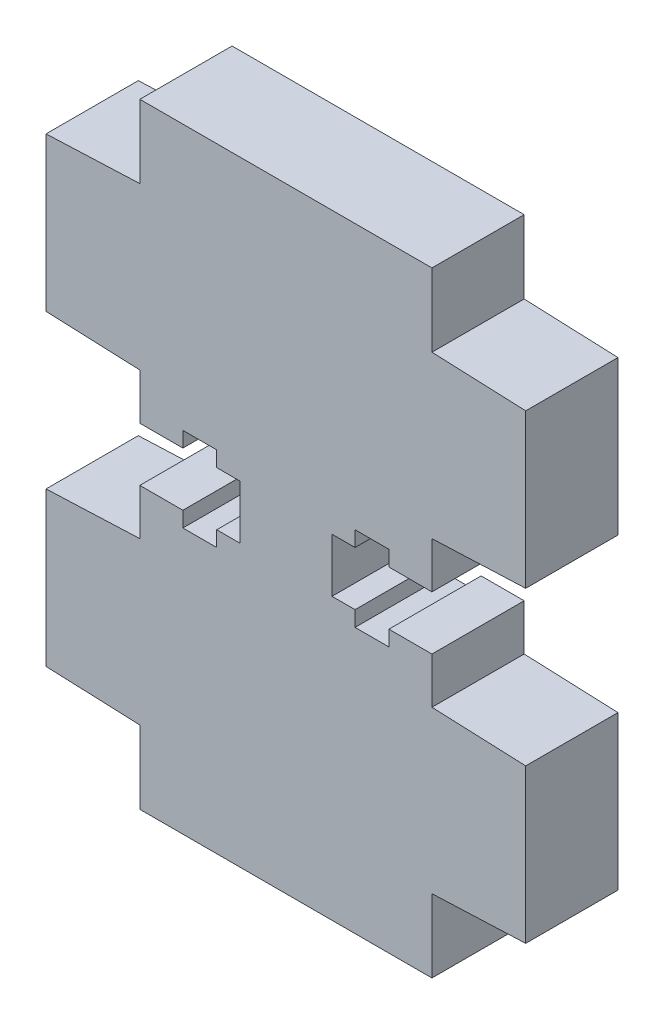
ISO-10303-21;
HEADER;
FILE_DESCRIPTION(('STEP AP214'),'2;1');
FILE_NAME('part.step','',(''),(''),'','','');
FILE_SCHEMA(('AUTOMOTIVE_DESIGN { 1 0 10303 214 1 1 1 1 }'));
ENDSEC;
DATA;
#1=APPLICATION_CONTEXT('core data for automotive mechanical design processes');
#2=APPLICATION_PROTOCOL_DEFINITION('international standard','automotive_design',2000,#1);
#3=PRODUCT_CONTEXT('',#1,'mechanical');
#4=PRODUCT('Part','Part','',(#3));
#5=PRODUCT_RELATED_PRODUCT_CATEGORY('part','',(#4));
#6=PRODUCT_DEFINITION_FORMATION('','',#4);
#7=PRODUCT_DEFINITION_CONTEXT('part definition',#1,'design');
#8=PRODUCT_DEFINITION('design','',#6,#7);
#9=PRODUCT_DEFINITION_SHAPE('','',#8);
#10=(LENGTH_UNIT() NAMED_UNIT(*) SI_UNIT(.MILLI.,.METRE.));
#11=(NAMED_UNIT(*) PLANE_ANGLE_UNIT() SI_UNIT($,.RADIAN.));
#12=(NAMED_UNIT(*) SI_UNIT($,.STERADIAN.) SOLID_ANGLE_UNIT());
#13=UNCERTAINTY_MEASURE_WITH_UNIT(LENGTH_MEASURE(1.E-05),#10,'distance_accuracy_value','');
#14=(GEOMETRIC_REPRESENTATION_CONTEXT(3) GLOBAL_UNCERTAINTY_ASSIGNED_CONTEXT((#13)) GLOBAL_UNIT_ASSIGNED_CONTEXT((#10,
#11,#12)) REPRESENTATION_CONTEXT('',''));
#15=CARTESIAN_POINT('',(0.,0.,0.));
#16=DIRECTION('',(0.,0.,1.));
#17=DIRECTION('',(1.,0.,0.));
#18=AXIS2_PLACEMENT_3D('',#15,#16,#17);
#19=CARTESIAN_POINT('',(3.,1.75,6.));
#20=DIRECTION('',(-1.,0.,0.));
#21=DIRECTION('',(0.,0.,1.));
#22=AXIS2_PLACEMENT_3D('',#19,#20,#21);
#23=PLANE('',#22);
#24=DIRECTION('',(0.,1.,0.));
#25=VECTOR('',#24,1.);
#26=CARTESIAN_POINT('',(3.,1.75,0.));
#27=LINE('',#26,#25);
#28=CARTESIAN_POINT('',(3.,-1.75,0.));
#29=VERTEX_POINT('',#28);
#30=CARTESIAN_POINT('',(3.,1.75,0.));
#31=VERTEX_POINT('',#30);
#32=EDGE_CURVE('E156',#29,#31,#27,.T.);
#33=ORIENTED_EDGE('',*,*,#32,.T.);
#34=DIRECTION('',(0.,0.,-1.));
#35=VECTOR('',#34,1.);
#36=CARTESIAN_POINT('',(3.,1.75,6.));
#37=LINE('',#36,#35);
#38=CARTESIAN_POINT('',(3.,1.75,6.));
#39=VERTEX_POINT('',#38);
#40=EDGE_CURVE('E11',#39,#31,#37,.T.);
#41=ORIENTED_EDGE('',*,*,#40,.F.);
#42=DIRECTION('',(0.,1.,0.));
#43=VECTOR('',#42,1.);
#44=CARTESIAN_POINT('',(3.,1.75,6.));
#45=LINE('',#44,#43);
#46=CARTESIAN_POINT('',(3.,-1.75,6.));
#47=VERTEX_POINT('',#46);
#48=EDGE_CURVE('E103',#47,#39,#45,.T.);
#49=ORIENTED_EDGE('',*,*,#48,.F.);
#50=DIRECTION('',(0.,0.,-1.));
#51=VECTOR('',#50,1.);
#52=CARTESIAN_POINT('',(3.,-1.75,6.));
#53=LINE('',#52,#51);
#54=EDGE_CURVE('E302',#47,#29,#53,.T.);
#55=ORIENTED_EDGE('',*,*,#54,.T.);
#56=EDGE_LOOP('',(#33,#41,#49,#55));
#57=FACE_BOUND('',#56,.T.);
#58=ADVANCED_FACE('F34',(#57),#23,.F.);
#59=CARTESIAN_POINT('',(4.5,1.75,6.));
#60=DIRECTION('',(0.,1.,0.));
#61=DIRECTION('',(-1.,0.,0.));
#62=AXIS2_PLACEMENT_3D('',#59,#60,#61);
#63=PLANE('',#62);
#64=DIRECTION('',(1.,0.,0.));
#65=VECTOR('',#64,1.);
#66=CARTESIAN_POINT('',(4.5,1.75,0.));
#67=LINE('',#66,#65);
#68=CARTESIAN_POINT('',(4.5,1.75,0.));
#69=VERTEX_POINT('',#68);
#70=EDGE_CURVE('E158',#31,#69,#67,.T.);
#71=ORIENTED_EDGE('',*,*,#70,.T.);
#72=DIRECTION('',(0.,0.,-1.));
#73=VECTOR('',#72,1.);
#74=CARTESIAN_POINT('',(4.5,1.75,6.));
#75=LINE('',#74,#73);
#76=CARTESIAN_POINT('',(4.5,1.75,6.));
#77=VERTEX_POINT('',#76);
#78=EDGE_CURVE('E42',#77,#69,#75,.T.);
#79=ORIENTED_EDGE('',*,*,#78,.F.);
#80=DIRECTION('',(1.,0.,0.));
#81=VECTOR('',#80,1.);
#82=CARTESIAN_POINT('',(4.5,1.75,6.));
#83=LINE('',#82,#81);
#84=EDGE_CURVE('E295',#39,#77,#83,.T.);
#85=ORIENTED_EDGE('',*,*,#84,.F.);
#86=ORIENTED_EDGE('',*,*,#40,.T.);
#87=EDGE_LOOP('',(#71,#79,#85,#86));
#88=FACE_BOUND('',#87,.T.);
#89=ADVANCED_FACE('F296',(#88),#63,.F.);
#90=CARTESIAN_POINT('',(4.5,2.75,6.));
#91=DIRECTION('',(-1.,0.,0.));
#92=DIRECTION('',(0.,-1.,0.));
#93=AXIS2_PLACEMENT_3D('',#90,#91,#92);
#94=PLANE('',#93);
#95=DIRECTION('',(0.,1.,0.));
#96=VECTOR('',#95,1.);
#97=CARTESIAN_POINT('',(4.5,2.75,0.));
#98=LINE('',#97,#96);
#99=CARTESIAN_POINT('',(4.5,2.75,0.));
#100=VERTEX_POINT('',#99);
#101=EDGE_CURVE('E161',#69,#100,#98,.T.);
#102=ORIENTED_EDGE('',*,*,#101,.T.);
#103=DIRECTION('',(0.,0.,-1.));
#104=VECTOR('',#103,1.);
#105=CARTESIAN_POINT('',(4.5,2.75,6.));
#106=LINE('',#105,#104);
#107=CARTESIAN_POINT('',(4.5,2.75,6.));
#108=VERTEX_POINT('',#107);
#109=EDGE_CURVE('E194',#108,#100,#106,.T.);
#110=ORIENTED_EDGE('',*,*,#109,.F.);
#111=DIRECTION('',(0.,1.,0.));
#112=VECTOR('',#111,1.);
#113=CARTESIAN_POINT('',(4.5,2.75,6.));
#114=LINE('',#113,#112);
#115=EDGE_CURVE('E203',#77,#108,#114,.T.);
#116=ORIENTED_EDGE('',*,*,#115,.F.);
#117=ORIENTED_EDGE('',*,*,#78,.T.);
#118=EDGE_LOOP('',(#102,#110,#116,#117));
#119=FACE_BOUND('',#118,.T.);
#120=ADVANCED_FACE('F201',(#119),#94,.F.);
#121=CARTESIAN_POINT('',(6.7,2.75,6.));
#122=DIRECTION('',(0.,1.,0.));
#123=DIRECTION('',(-1.,0.,0.));
#124=AXIS2_PLACEMENT_3D('',#121,#122,#123);
#125=PLANE('',#124);
#126=DIRECTION('',(1.,0.,0.));
#127=VECTOR('',#126,1.);
#128=CARTESIAN_POINT('',(6.7,2.75,0.));
#129=LINE('',#128,#127);
#130=CARTESIAN_POINT('',(6.7,2.75,0.));
#131=VERTEX_POINT('',#130);
#132=EDGE_CURVE('E163',#100,#131,#129,.T.);
#133=ORIENTED_EDGE('',*,*,#132,.T.);
#134=DIRECTION('',(0.,0.,-1.));
#135=VECTOR('',#134,1.);
#136=CARTESIAN_POINT('',(6.7,2.75,6.));
#137=LINE('',#136,#135);
#138=CARTESIAN_POINT('',(6.7,2.75,6.));
#139=VERTEX_POINT('',#138);
#140=EDGE_CURVE('E191',#139,#131,#137,.T.);
#141=ORIENTED_EDGE('',*,*,#140,.F.);
#142=DIRECTION('',(1.,0.,0.));
#143=VECTOR('',#142,1.);
#144=CARTESIAN_POINT('',(6.7,2.75,6.));
#145=LINE('',#144,#143);
#146=EDGE_CURVE('E224',#108,#139,#145,.T.);
#147=ORIENTED_EDGE('',*,*,#146,.F.);
#148=ORIENTED_EDGE('',*,*,#109,.T.);
#149=EDGE_LOOP('',(#133,#141,#147,#148));
#150=FACE_BOUND('',#149,.T.);
#151=ADVANCED_FACE('F215',(#150),#125,.F.);
#152=CARTESIAN_POINT('',(6.7,1.75,6.));
#153=DIRECTION('',(1.,0.,0.));
#154=DIRECTION('',(0.,1.,0.));
#155=AXIS2_PLACEMENT_3D('',#152,#153,#154);
#156=PLANE('',#155);
#157=DIRECTION('',(0.,-1.,0.));
#158=VECTOR('',#157,1.);
#159=CARTESIAN_POINT('',(6.7,1.75,0.));
#160=LINE('',#159,#158);
#161=CARTESIAN_POINT('',(6.7,1.75,0.));
#162=VERTEX_POINT('',#161);
#163=EDGE_CURVE('E165',#131,#162,#160,.T.);
#164=ORIENTED_EDGE('',*,*,#163,.T.);
#165=DIRECTION('',(0.,0.,-1.));
#166=VECTOR('',#165,1.);
#167=CARTESIAN_POINT('',(6.7,1.75,6.));
#168=LINE('',#167,#166);
#169=CARTESIAN_POINT('',(6.7,1.75,6.));
#170=VERTEX_POINT('',#169);
#171=EDGE_CURVE('E188',#170,#162,#168,.T.);
#172=ORIENTED_EDGE('',*,*,#171,.F.);
#173=DIRECTION('',(0.,-1.,0.));
#174=VECTOR('',#173,1.);
#175=CARTESIAN_POINT('',(6.7,1.75,6.));
#176=LINE('',#175,#174);
#177=EDGE_CURVE('E221',#139,#170,#176,.T.);
#178=ORIENTED_EDGE('',*,*,#177,.F.);
#179=ORIENTED_EDGE('',*,*,#140,.T.);
#180=EDGE_LOOP('',(#164,#172,#178,#179));
#181=FACE_BOUND('',#180,.T.);
#182=ADVANCED_FACE('F219',(#181),#156,.F.);
#183=CARTESIAN_POINT('',(9.5,1.75,6.));
#184=DIRECTION('',(0.,1.,0.));
#185=DIRECTION('',(-1.,0.,0.));
#186=AXIS2_PLACEMENT_3D('',#183,#184,#185);
#187=PLANE('',#186);
#188=DIRECTION('',(1.,0.,0.));
#189=VECTOR('',#188,1.);
#190=CARTESIAN_POINT('',(9.5,1.75,0.));
#191=LINE('',#190,#189);
#192=CARTESIAN_POINT('',(9.5,1.75,0.));
#193=VERTEX_POINT('',#192);
#194=EDGE_CURVE('E167',#162,#193,#191,.T.);
#195=ORIENTED_EDGE('',*,*,#194,.T.);
#196=DIRECTION('',(0.,0.,-1.));
#197=VECTOR('',#196,1.);
#198=CARTESIAN_POINT('',(9.5,1.75,6.));
#199=LINE('',#198,#197);
#200=CARTESIAN_POINT('',(9.5,1.75,6.));
#201=VERTEX_POINT('',#200);
#202=EDGE_CURVE('E185',#201,#193,#199,.T.);
#203=ORIENTED_EDGE('',*,*,#202,.F.);
#204=DIRECTION('',(1.,0.,0.));
#205=VECTOR('',#204,1.);
#206=CARTESIAN_POINT('',(9.5,1.75,6.));
#207=LINE('',#206,#205);
#208=EDGE_CURVE('E223',#170,#201,#207,.T.);
#209=ORIENTED_EDGE('',*,*,#208,.F.);
#210=ORIENTED_EDGE('',*,*,#171,.T.);
#211=EDGE_LOOP('',(#195,#203,#209,#210));
#212=FACE_BOUND('',#211,.T.);
#213=ADVANCED_FACE('F812',(#212),#187,.F.);
#214=CARTESIAN_POINT('',(9.5,4.75,6.));
#215=DIRECTION('',(-1.,0.,0.));
#216=DIRECTION('',(0.,0.,1.));
#217=AXIS2_PLACEMENT_3D('',#214,#215,#216);
#218=PLANE('',#217);
#219=DIRECTION('',(0.,1.,0.));
#220=VECTOR('',#219,1.);
#221=CARTESIAN_POINT('',(9.5,4.75,0.));
#222=LINE('',#221,#220);
#223=CARTESIAN_POINT('',(9.5,4.75,0.));
#224=VERTEX_POINT('',#223);
#225=EDGE_CURVE('E169',#193,#224,#222,.T.);
#226=ORIENTED_EDGE('',*,*,#225,.T.);
#227=DIRECTION('',(0.,0.,-1.));
#228=VECTOR('',#227,1.);
#229=CARTESIAN_POINT('',(9.5,4.75,6.));
#230=LINE('',#229,#228);
#231=CARTESIAN_POINT('',(9.5,4.75,6.));
#232=VERTEX_POINT('',#231);
#233=EDGE_CURVE('E182',#232,#224,#230,.T.);
#234=ORIENTED_EDGE('',*,*,#233,.F.);
#235=DIRECTION('',(0.,1.,0.));
#236=VECTOR('',#235,1.);
#237=CARTESIAN_POINT('',(9.5,4.75,6.));
#238=LINE('',#237,#236);
#239=EDGE_CURVE('E226',#201,#232,#238,.T.);
#240=ORIENTED_EDGE('',*,*,#239,.F.);
#241=ORIENTED_EDGE('',*,*,#202,.T.);
#242=EDGE_LOOP('',(#226,#234,#240,#241));
#243=FACE_BOUND('',#242,.T.);
#244=ADVANCED_FACE('F235',(#243),#218,.F.);
#245=CARTESIAN_POINT('',(15.6,5.,6.));
#246=DIRECTION('',(-0.0409492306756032,0.999161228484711,0.));
#247=DIRECTION('',(-0.999161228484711,-0.0409492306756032,0.));
#248=AXIS2_PLACEMENT_3D('',#245,#246,#247);
#249=PLANE('',#248);
#250=DIRECTION('',(0.999161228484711,0.0409492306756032,0.));
#251=VECTOR('',#250,1.);
#252=CARTESIAN_POINT('',(15.6,5.,0.));
#253=LINE('',#252,#251);
#254=CARTESIAN_POINT('',(15.6,5.,0.));
#255=VERTEX_POINT('',#254);
#256=EDGE_CURVE('E171',#224,#255,#253,.T.);
#257=ORIENTED_EDGE('',*,*,#256,.T.);
#258=DIRECTION('',(0.,0.,-1.));
#259=VECTOR('',#258,1.);
#260=CARTESIAN_POINT('',(15.6,5.,6.));
#261=LINE('',#260,#259);
#262=CARTESIAN_POINT('',(15.6,5.,6.));
#263=VERTEX_POINT('',#262);
#264=EDGE_CURVE('E145',#263,#255,#261,.T.);
#265=ORIENTED_EDGE('',*,*,#264,.F.);
#266=DIRECTION('',(0.999161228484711,0.0409492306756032,0.));
#267=VECTOR('',#266,1.);
#268=CARTESIAN_POINT('',(15.6,5.,6.));
#269=LINE('',#268,#267);
#270=EDGE_CURVE('E136',#232,#263,#269,.T.);
#271=ORIENTED_EDGE('',*,*,#270,.F.);
#272=ORIENTED_EDGE('',*,*,#233,.T.);
#273=EDGE_LOOP('',(#257,#265,#271,#272));
#274=FACE_BOUND('',#273,.T.);
#275=ADVANCED_FACE('F239',(#274),#249,.F.);
#276=CARTESIAN_POINT('',(15.6,15.,6.));
#277=DIRECTION('',(-1.,0.,0.));
#278=DIRECTION('',(0.,-1.,0.));
#279=AXIS2_PLACEMENT_3D('',#276,#277,#278);
#280=PLANE('',#279);
#281=DIRECTION('',(0.,1.,0.));
#282=VECTOR('',#281,1.);
#283=CARTESIAN_POINT('',(15.6,15.,0.));
#284=LINE('',#283,#282);
#285=CARTESIAN_POINT('',(15.6,15.,0.));
#286=VERTEX_POINT('',#285);
#287=EDGE_CURVE('E144',#255,#286,#284,.T.);
#288=ORIENTED_EDGE('',*,*,#287,.T.);
#289=DIRECTION('',(0.,0.,-1.));
#290=VECTOR('',#289,1.);
#291=CARTESIAN_POINT('',(15.6,15.,6.));
#292=LINE('',#291,#290);
#293=CARTESIAN_POINT('',(15.6,15.,6.));
#294=VERTEX_POINT('',#293);
#295=EDGE_CURVE('E141',#294,#286,#292,.T.);
#296=ORIENTED_EDGE('',*,*,#295,.F.);
#297=DIRECTION('',(0.,1.,0.));
#298=VECTOR('',#297,1.);
#299=CARTESIAN_POINT('',(15.6,15.,6.));
#300=LINE('',#299,#298);
#301=EDGE_CURVE('E129',#263,#294,#300,.T.);
#302=ORIENTED_EDGE('',*,*,#301,.F.);
#303=ORIENTED_EDGE('',*,*,#264,.T.);
#304=EDGE_LOOP('',(#288,#296,#302,#303));
#305=FACE_BOUND('',#304,.T.);
#306=ADVANCED_FACE('F142',(#305),#280,.F.);
#307=CARTESIAN_POINT('',(9.5,15.25,6.));
#308=DIRECTION('',(-0.0409492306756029,-0.999161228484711,0.));
#309=DIRECTION('',(0.999161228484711,-0.0409492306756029,0.));
#310=AXIS2_PLACEMENT_3D('',#307,#308,#309);
#311=PLANE('',#310);
#312=DIRECTION('',(-0.999161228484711,0.0409492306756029,0.));
#313=VECTOR('',#312,1.);
#314=CARTESIAN_POINT('',(9.5,15.25,0.));
#315=LINE('',#314,#313);
#316=CARTESIAN_POINT('',(9.5,15.25,0.));
#317=VERTEX_POINT('',#316);
#318=EDGE_CURVE('E89',#286,#317,#315,.T.);
#319=ORIENTED_EDGE('',*,*,#318,.T.);
#320=DIRECTION('',(0.,0.,-1.));
#321=VECTOR('',#320,1.);
#322=CARTESIAN_POINT('',(9.5,15.25,6.));
#323=LINE('',#322,#321);
#324=CARTESIAN_POINT('',(9.5,15.25,6.));
#325=VERTEX_POINT('',#324);
#326=EDGE_CURVE('E146',#325,#317,#323,.T.);
#327=ORIENTED_EDGE('',*,*,#326,.F.);
#328=DIRECTION('',(-0.999161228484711,0.0409492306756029,0.));
#329=VECTOR('',#328,1.);
#330=CARTESIAN_POINT('',(9.5,15.25,6.));
#331=LINE('',#330,#329);
#332=EDGE_CURVE('E134',#294,#325,#331,.T.);
#333=ORIENTED_EDGE('',*,*,#332,.F.);
#334=ORIENTED_EDGE('',*,*,#295,.T.);
#335=EDGE_LOOP('',(#319,#327,#333,#334));
#336=FACE_BOUND('',#335,.T.);
#337=ADVANCED_FACE('F148',(#336),#311,.F.);
#338=CARTESIAN_POINT('',(9.5,20.,6.));
#339=DIRECTION('',(-1.,0.,0.));
#340=DIRECTION('',(0.,0.,1.));
#341=AXIS2_PLACEMENT_3D('',#338,#339,#340);
#342=PLANE('',#341);
#343=DIRECTION('',(0.,1.,0.));
#344=VECTOR('',#343,1.);
#345=CARTESIAN_POINT('',(9.5,20.,0.));
#346=LINE('',#345,#344);
#347=CARTESIAN_POINT('',(9.5,20.,0.));
#348=VERTEX_POINT('',#347);
#349=EDGE_CURVE('E95',#317,#348,#346,.T.);
#350=ORIENTED_EDGE('',*,*,#349,.T.);
#351=DIRECTION('',(0.,0.,-1.));
#352=VECTOR('',#351,1.);
#353=CARTESIAN_POINT('',(9.5,20.,6.));
#354=LINE('',#353,#352);
#355=CARTESIAN_POINT('',(9.5,20.,6.));
#356=VERTEX_POINT('',#355);
#357=EDGE_CURVE('E155',#356,#348,#354,.T.);
#358=ORIENTED_EDGE('',*,*,#357,.F.);
#359=DIRECTION('',(0.,1.,0.));
#360=VECTOR('',#359,1.);
#361=CARTESIAN_POINT('',(9.5,20.,6.));
#362=LINE('',#361,#360);
#363=EDGE_CURVE('E50',#325,#356,#362,.T.);
#364=ORIENTED_EDGE('',*,*,#363,.F.);
#365=ORIENTED_EDGE('',*,*,#326,.T.);
#366=EDGE_LOOP('',(#350,#358,#364,#365));
#367=FACE_BOUND('',#366,.T.);
#368=ADVANCED_FACE('F824',(#367),#342,.F.);
#369=CARTESIAN_POINT('',(0.,20.,6.));
#370=DIRECTION('',(0.,-1.,0.));
#371=DIRECTION('',(0.,0.,-1.));
#372=AXIS2_PLACEMENT_3D('',#369,#370,#371);
#373=PLANE('',#372);
#374=DIRECTION('',(-1.,0.,0.));
#375=VECTOR('',#374,1.);
#376=CARTESIAN_POINT('',(0.,20.,0.));
#377=LINE('',#376,#375);
#378=CARTESIAN_POINT('',(-9.5,20.,0.));
#379=VERTEX_POINT('',#378);
#380=EDGE_CURVE('E176',#348,#379,#377,.T.);
#381=ORIENTED_EDGE('',*,*,#380,.T.);
#382=DIRECTION('',(0.,0.,-1.));
#383=VECTOR('',#382,1.);
#384=CARTESIAN_POINT('',(-9.5,20.,6.));
#385=LINE('',#384,#383);
#386=CARTESIAN_POINT('',(-9.5,20.,6.));
#387=VERTEX_POINT('',#386);
#388=EDGE_CURVE('E250',#387,#379,#385,.T.);
#389=ORIENTED_EDGE('',*,*,#388,.F.);
#390=DIRECTION('',(-1.,0.,0.));
#391=VECTOR('',#390,1.);
#392=CARTESIAN_POINT('',(0.,20.,6.));
#393=LINE('',#392,#391);
#394=EDGE_CURVE('E150',#356,#387,#393,.T.);
#395=ORIENTED_EDGE('',*,*,#394,.F.);
#396=ORIENTED_EDGE('',*,*,#357,.T.);
#397=EDGE_LOOP('',(#381,#389,#395,#396));
#398=FACE_BOUND('',#397,.T.);
#399=ADVANCED_FACE('F248',(#398),#373,.F.);
#400=CARTESIAN_POINT('',(0.,0.,6.));
#401=DIRECTION('',(0.,0.,-1.));
#402=DIRECTION('',(-1.,0.,0.));
#403=AXIS2_PLACEMENT_3D('',#400,#401,#402);
#404=PLANE('',#403);
#405=DIRECTION('',(0.,1.,0.));
#406=VECTOR('',#405,1.);
#407=CARTESIAN_POINT('',(-3.,1.75,6.));
#408=LINE('',#407,#406);
#409=CARTESIAN_POINT('',(-3.,-1.75,6.));
#410=VERTEX_POINT('',#409);
#411=CARTESIAN_POINT('',(-3.,1.75,6.));
#412=VERTEX_POINT('',#411);
#413=EDGE_CURVE('E385',#410,#412,#408,.T.);
#414=ORIENTED_EDGE('',*,*,#413,.F.);
#415=DIRECTION('',(-1.,0.,0.));
#416=VECTOR('',#415,1.);
#417=CARTESIAN_POINT('',(-4.5,-1.75,6.));
#418=LINE('',#417,#416);
#419=CARTESIAN_POINT('',(-4.5,-1.75,6.));
#420=VERTEX_POINT('',#419);
#421=EDGE_CURVE('E643',#410,#420,#418,.T.);
#422=ORIENTED_EDGE('',*,*,#421,.T.);
#423=DIRECTION('',(0.,-1.,0.));
#424=VECTOR('',#423,1.);
#425=CARTESIAN_POINT('',(-4.5,-2.75,6.));
#426=LINE('',#425,#424);
#427=CARTESIAN_POINT('',(-4.5,-2.75,6.));
#428=VERTEX_POINT('',#427);
#429=EDGE_CURVE('E652',#420,#428,#426,.T.);
#430=ORIENTED_EDGE('',*,*,#429,.T.);
#431=DIRECTION('',(-1.,0.,0.));
#432=VECTOR('',#431,1.);
#433=CARTESIAN_POINT('',(-6.7,-2.75,6.));
#434=LINE('',#433,#432);
#435=CARTESIAN_POINT('',(-6.7,-2.75,6.));
#436=VERTEX_POINT('',#435);
#437=EDGE_CURVE('E655',#428,#436,#434,.T.);
#438=ORIENTED_EDGE('',*,*,#437,.T.);
#439=DIRECTION('',(0.,1.,0.));
#440=VECTOR('',#439,1.);
#441=CARTESIAN_POINT('',(-6.7,-1.75,6.));
#442=LINE('',#441,#440);
#443=CARTESIAN_POINT('',(-6.7,-1.75,6.));
#444=VERTEX_POINT('',#443);
#445=EDGE_CURVE('E662',#436,#444,#442,.T.);
#446=ORIENTED_EDGE('',*,*,#445,.T.);
#447=DIRECTION('',(-1.,0.,0.));
#448=VECTOR('',#447,1.);
#449=CARTESIAN_POINT('',(-9.5,-1.75,6.));
#450=LINE('',#449,#448);
#451=CARTESIAN_POINT('',(-9.5,-1.75,6.));
#452=VERTEX_POINT('',#451);
#453=EDGE_CURVE('E665',#444,#452,#450,.T.);
#454=ORIENTED_EDGE('',*,*,#453,.T.);
#455=DIRECTION('',(0.,-1.,0.));
#456=VECTOR('',#455,1.);
#457=CARTESIAN_POINT('',(-9.5,-4.75,6.));
#458=LINE('',#457,#456);
#459=CARTESIAN_POINT('',(-9.5,-4.75,6.));
#460=VERTEX_POINT('',#459);
#461=EDGE_CURVE('E668',#452,#460,#458,.T.);
#462=ORIENTED_EDGE('',*,*,#461,.T.);
#463=DIRECTION('',(-0.999161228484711,-0.0409492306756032,0.));
#464=VECTOR('',#463,1.);
#465=CARTESIAN_POINT('',(-15.6,-5.,6.));
#466=LINE('',#465,#464);
#467=CARTESIAN_POINT('',(-15.6,-5.,6.));
#468=VERTEX_POINT('',#467);
#469=EDGE_CURVE('E671',#460,#468,#466,.T.);
#470=ORIENTED_EDGE('',*,*,#469,.T.);
#471=DIRECTION('',(0.,-1.,0.));
#472=VECTOR('',#471,1.);
#473=CARTESIAN_POINT('',(-15.6,-15.,6.));
#474=LINE('',#473,#472);
#475=CARTESIAN_POINT('',(-15.6,-15.,6.));
#476=VERTEX_POINT('',#475);
#477=EDGE_CURVE('E674',#468,#476,#474,.T.);
#478=ORIENTED_EDGE('',*,*,#477,.T.);
#479=DIRECTION('',(0.999161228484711,-0.0409492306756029,0.));
#480=VECTOR('',#479,1.);
#481=CARTESIAN_POINT('',(-9.5,-15.25,6.));
#482=LINE('',#481,#480);
#483=CARTESIAN_POINT('',(-9.5,-15.25,6.));
#484=VERTEX_POINT('',#483);
#485=EDGE_CURVE('E677',#476,#484,#482,.T.);
#486=ORIENTED_EDGE('',*,*,#485,.T.);
#487=DIRECTION('',(0.,-1.,0.));
#488=VECTOR('',#487,1.);
#489=CARTESIAN_POINT('',(-9.5,-20.,6.));
#490=LINE('',#489,#488);
#491=CARTESIAN_POINT('',(-9.5,-20.,6.));
#492=VERTEX_POINT('',#491);
#493=EDGE_CURVE('E680',#484,#492,#490,.T.);
#494=ORIENTED_EDGE('',*,*,#493,.T.);
#495=DIRECTION('',(-1.,0.,0.));
#496=VECTOR('',#495,1.);
#497=CARTESIAN_POINT('',(0.,-20.,6.));
#498=LINE('',#497,#496);
#499=CARTESIAN_POINT('',(9.5,-20.,6.));
#500=VERTEX_POINT('',#499);
#501=EDGE_CURVE('E325',#500,#492,#498,.T.);
#502=ORIENTED_EDGE('',*,*,#501,.F.);
#503=DIRECTION('',(0.,-1.,0.));
#504=VECTOR('',#503,1.);
#505=CARTESIAN_POINT('',(9.5,-20.,6.));
#506=LINE('',#505,#504);
#507=CARTESIAN_POINT('',(9.5,-15.25,6.));
#508=VERTEX_POINT('',#507);
#509=EDGE_CURVE('E751',#508,#500,#506,.T.);
#510=ORIENTED_EDGE('',*,*,#509,.F.);
#511=DIRECTION('',(-0.999161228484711,-0.0409492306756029,0.));
#512=VECTOR('',#511,1.);
#513=CARTESIAN_POINT('',(9.5,-15.25,6.));
#514=LINE('',#513,#512);
#515=CARTESIAN_POINT('',(15.6,-15.,6.));
#516=VERTEX_POINT('',#515);
#517=EDGE_CURVE('E749',#516,#508,#514,.T.);
#518=ORIENTED_EDGE('',*,*,#517,.F.);
#519=DIRECTION('',(0.,-1.,0.));
#520=VECTOR('',#519,1.);
#521=CARTESIAN_POINT('',(15.6,-15.,6.));
#522=LINE('',#521,#520);
#523=CARTESIAN_POINT('',(15.6,-5.,6.));
#524=VERTEX_POINT('',#523);
#525=EDGE_CURVE('E746',#524,#516,#522,.T.);
#526=ORIENTED_EDGE('',*,*,#525,.F.);
#527=DIRECTION('',(0.999161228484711,-0.0409492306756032,0.));
#528=VECTOR('',#527,1.);
#529=CARTESIAN_POINT('',(15.6,-5.,6.));
#530=LINE('',#529,#528);
#531=CARTESIAN_POINT('',(9.5,-4.75,6.));
#532=VERTEX_POINT('',#531);
#533=EDGE_CURVE('E743',#532,#524,#530,.T.);
#534=ORIENTED_EDGE('',*,*,#533,.F.);
#535=DIRECTION('',(0.,-1.,0.));
#536=VECTOR('',#535,1.);
#537=CARTESIAN_POINT('',(9.5,-4.75,6.));
#538=LINE('',#537,#536);
#539=CARTESIAN_POINT('',(9.5,-1.75,6.));
#540=VERTEX_POINT('',#539);
#541=EDGE_CURVE('E740',#540,#532,#538,.T.);
#542=ORIENTED_EDGE('',*,*,#541,.F.);
#543=DIRECTION('',(1.,0.,0.));
#544=VECTOR('',#543,1.);
#545=CARTESIAN_POINT('',(9.5,-1.75,6.));
#546=LINE('',#545,#544);
#547=CARTESIAN_POINT('',(6.7,-1.75,6.));
#548=VERTEX_POINT('',#547);
#549=EDGE_CURVE('E737',#548,#540,#546,.T.);
#550=ORIENTED_EDGE('',*,*,#549,.F.);
#551=DIRECTION('',(0.,1.,0.));
#552=VECTOR('',#551,1.);
#553=CARTESIAN_POINT('',(6.7,-1.75,6.));
#554=LINE('',#553,#552);
#555=CARTESIAN_POINT('',(6.7,-2.75,6.));
#556=VERTEX_POINT('',#555);
#557=EDGE_CURVE('E734',#556,#548,#554,.T.);
#558=ORIENTED_EDGE('',*,*,#557,.F.);
#559=DIRECTION('',(1.,0.,0.));
#560=VECTOR('',#559,1.);
#561=CARTESIAN_POINT('',(6.7,-2.75,6.));
#562=LINE('',#561,#560);
#563=CARTESIAN_POINT('',(4.5,-2.75,6.));
#564=VERTEX_POINT('',#563);
#565=EDGE_CURVE('E731',#564,#556,#562,.T.);
#566=ORIENTED_EDGE('',*,*,#565,.F.);
#567=DIRECTION('',(0.,-1.,0.));
#568=VECTOR('',#567,1.);
#569=CARTESIAN_POINT('',(4.5,-2.75,6.));
#570=LINE('',#569,#568);
#571=CARTESIAN_POINT('',(4.5,-1.75,6.));
#572=VERTEX_POINT('',#571);
#573=EDGE_CURVE('E728',#572,#564,#570,.T.);
#574=ORIENTED_EDGE('',*,*,#573,.F.);
#575=DIRECTION('',(1.,0.,0.));
#576=VECTOR('',#575,1.);
#577=CARTESIAN_POINT('',(4.5,-1.75,6.));
#578=LINE('',#577,#576);
#579=EDGE_CURVE('E354',#47,#572,#578,.T.);
#580=ORIENTED_EDGE('',*,*,#579,.F.);
#581=ORIENTED_EDGE('',*,*,#48,.T.);
#582=ORIENTED_EDGE('',*,*,#84,.T.);
#583=ORIENTED_EDGE('',*,*,#115,.T.);
#584=ORIENTED_EDGE('',*,*,#146,.T.);
#585=ORIENTED_EDGE('',*,*,#177,.T.);
#586=ORIENTED_EDGE('',*,*,#208,.T.);
#587=ORIENTED_EDGE('',*,*,#239,.T.);
#588=ORIENTED_EDGE('',*,*,#270,.T.);
#589=ORIENTED_EDGE('',*,*,#301,.T.);
#590=ORIENTED_EDGE('',*,*,#332,.T.);
#591=ORIENTED_EDGE('',*,*,#363,.T.);
#592=ORIENTED_EDGE('',*,*,#394,.T.);
#593=DIRECTION('',(0.,1.,0.));
#594=VECTOR('',#593,1.);
#595=CARTESIAN_POINT('',(-9.5,20.,6.));
#596=LINE('',#595,#594);
#597=CARTESIAN_POINT('',(-9.5,15.25,6.));
#598=VERTEX_POINT('',#597);
#599=EDGE_CURVE('E259',#598,#387,#596,.T.);
#600=ORIENTED_EDGE('',*,*,#599,.F.);
#601=DIRECTION('',(0.999161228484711,0.0409492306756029,0.));
#602=VECTOR('',#601,1.);
#603=CARTESIAN_POINT('',(-9.5,15.25,6.));
#604=LINE('',#603,#602);
#605=CARTESIAN_POINT('',(-15.6,15.,6.));
#606=VERTEX_POINT('',#605);
#607=EDGE_CURVE('E264',#606,#598,#604,.T.);
#608=ORIENTED_EDGE('',*,*,#607,.F.);
#609=DIRECTION('',(0.,1.,0.));
#610=VECTOR('',#609,1.);
#611=CARTESIAN_POINT('',(-15.6,15.,6.));
#612=LINE('',#611,#610);
#613=CARTESIAN_POINT('',(-15.6,5.,6.));
#614=VERTEX_POINT('',#613);
#615=EDGE_CURVE('E409',#614,#606,#612,.T.);
#616=ORIENTED_EDGE('',*,*,#615,.F.);
#617=DIRECTION('',(-0.999161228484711,0.0409492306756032,0.));
#618=VECTOR('',#617,1.);
#619=CARTESIAN_POINT('',(-15.6,5.,6.));
#620=LINE('',#619,#618);
#621=CARTESIAN_POINT('',(-9.5,4.75,6.));
#622=VERTEX_POINT('',#621);
#623=EDGE_CURVE('E406',#622,#614,#620,.T.);
#624=ORIENTED_EDGE('',*,*,#623,.F.);
#625=DIRECTION('',(0.,1.,0.));
#626=VECTOR('',#625,1.);
#627=CARTESIAN_POINT('',(-9.5,4.75,6.));
#628=LINE('',#627,#626);
#629=CARTESIAN_POINT('',(-9.5,1.75,6.));
#630=VERTEX_POINT('',#629);
#631=EDGE_CURVE('E403',#630,#622,#628,.T.);
#632=ORIENTED_EDGE('',*,*,#631,.F.);
#633=DIRECTION('',(-1.,0.,0.));
#634=VECTOR('',#633,1.);
#635=CARTESIAN_POINT('',(-9.5,1.75,6.));
#636=LINE('',#635,#634);
#637=CARTESIAN_POINT('',(-6.7,1.75,6.));
#638=VERTEX_POINT('',#637);
#639=EDGE_CURVE('E400',#638,#630,#636,.T.);
#640=ORIENTED_EDGE('',*,*,#639,.F.);
#641=DIRECTION('',(0.,-1.,0.));
#642=VECTOR('',#641,1.);
#643=CARTESIAN_POINT('',(-6.7,1.75,6.));
#644=LINE('',#643,#642);
#645=CARTESIAN_POINT('',(-6.7,2.75,6.));
#646=VERTEX_POINT('',#645);
#647=EDGE_CURVE('E397',#646,#638,#644,.T.);
#648=ORIENTED_EDGE('',*,*,#647,.F.);
#649=DIRECTION('',(-1.,0.,0.));
#650=VECTOR('',#649,1.);
#651=CARTESIAN_POINT('',(-6.7,2.75,6.));
#652=LINE('',#651,#650);
#653=CARTESIAN_POINT('',(-4.5,2.75,6.));
#654=VERTEX_POINT('',#653);
#655=EDGE_CURVE('E394',#654,#646,#652,.T.);
#656=ORIENTED_EDGE('',*,*,#655,.F.);
#657=DIRECTION('',(0.,1.,0.));
#658=VECTOR('',#657,1.);
#659=CARTESIAN_POINT('',(-4.5,2.75,6.));
#660=LINE('',#659,#658);
#661=CARTESIAN_POINT('',(-4.5,1.75,6.));
#662=VERTEX_POINT('',#661);
#663=EDGE_CURVE('E391',#662,#654,#660,.T.);
#664=ORIENTED_EDGE('',*,*,#663,.F.);
#665=DIRECTION('',(-1.,0.,0.));
#666=VECTOR('',#665,1.);
#667=CARTESIAN_POINT('',(-4.5,1.75,6.));
#668=LINE('',#667,#666);
#669=EDGE_CURVE('E388',#412,#662,#668,.T.);
#670=ORIENTED_EDGE('',*,*,#669,.F.);
#671=EDGE_LOOP('',(#414,#422,#430,#438,#446,#454,#462,#470,#478,#486,#494,#502,#510,#518,#526,
#534,#542,#550,#558,#566,#574,#580,#581,#582,#583,#584,#585,#586,#587,#588,#589,#590,#591,#592,
#600,#608,#616,#624,#632,#640,#648,#656,#664,#670));
#672=FACE_BOUND('',#671,.T.);
#673=ADVANCED_FACE('F132',(#672),#404,.F.);
#674=CARTESIAN_POINT('',(0.,0.,0.));
#675=DIRECTION('',(0.,0.,-1.));
#676=DIRECTION('',(-1.,0.,0.));
#677=AXIS2_PLACEMENT_3D('',#674,#675,#676);
#678=PLANE('',#677);
#679=ORIENTED_EDGE('',*,*,#32,.F.);
#680=DIRECTION('',(1.,0.,0.));
#681=VECTOR('',#680,1.);
#682=CARTESIAN_POINT('',(4.5,-1.75,0.));
#683=LINE('',#682,#681);
#684=CARTESIAN_POINT('',(4.5,-1.75,0.));
#685=VERTEX_POINT('',#684);
#686=EDGE_CURVE('E307',#29,#685,#683,.T.);
#687=ORIENTED_EDGE('',*,*,#686,.T.);
#688=DIRECTION('',(0.,-1.,0.));
#689=VECTOR('',#688,1.);
#690=CARTESIAN_POINT('',(4.5,-2.75,0.));
#691=LINE('',#690,#689);
#692=CARTESIAN_POINT('',(4.5,-2.75,0.));
#693=VERTEX_POINT('',#692);
#694=EDGE_CURVE('E316',#685,#693,#691,.T.);
#695=ORIENTED_EDGE('',*,*,#694,.T.);
#696=DIRECTION('',(1.,0.,0.));
#697=VECTOR('',#696,1.);
#698=CARTESIAN_POINT('',(6.7,-2.75,0.));
#699=LINE('',#698,#697);
#700=CARTESIAN_POINT('',(6.7,-2.75,0.));
#701=VERTEX_POINT('',#700);
#702=EDGE_CURVE('E319',#693,#701,#699,.T.);
#703=ORIENTED_EDGE('',*,*,#702,.T.);
#704=DIRECTION('',(0.,1.,0.));
#705=VECTOR('',#704,1.);
#706=CARTESIAN_POINT('',(6.7,-1.75,0.));
#707=LINE('',#706,#705);
#708=CARTESIAN_POINT('',(6.7,-1.75,0.));
#709=VERTEX_POINT('',#708);
#710=EDGE_CURVE('E330',#701,#709,#707,.T.);
#711=ORIENTED_EDGE('',*,*,#710,.T.);
#712=DIRECTION('',(1.,0.,0.));
#713=VECTOR('',#712,1.);
#714=CARTESIAN_POINT('',(9.5,-1.75,0.));
#715=LINE('',#714,#713);
#716=CARTESIAN_POINT('',(9.5,-1.75,0.));
#717=VERTEX_POINT('',#716);
#718=EDGE_CURVE('E333',#709,#717,#715,.T.);
#719=ORIENTED_EDGE('',*,*,#718,.T.);
#720=DIRECTION('',(0.,-1.,0.));
#721=VECTOR('',#720,1.);
#722=CARTESIAN_POINT('',(9.5,-4.75,0.));
#723=LINE('',#722,#721);
#724=CARTESIAN_POINT('',(9.5,-4.75,0.));
#725=VERTEX_POINT('',#724);
#726=EDGE_CURVE('E336',#717,#725,#723,.T.);
#727=ORIENTED_EDGE('',*,*,#726,.T.);
#728=DIRECTION('',(0.999161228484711,-0.0409492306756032,0.));
#729=VECTOR('',#728,1.);
#730=CARTESIAN_POINT('',(15.6,-5.,0.));
#731=LINE('',#730,#729);
#732=CARTESIAN_POINT('',(15.6,-5.,0.));
#733=VERTEX_POINT('',#732);
#734=EDGE_CURVE('E339',#725,#733,#731,.T.);
#735=ORIENTED_EDGE('',*,*,#734,.T.);
#736=DIRECTION('',(0.,-1.,0.));
#737=VECTOR('',#736,1.);
#738=CARTESIAN_POINT('',(15.6,-15.,0.));
#739=LINE('',#738,#737);
#740=CARTESIAN_POINT('',(15.6,-15.,0.));
#741=VERTEX_POINT('',#740);
#742=EDGE_CURVE('E342',#733,#741,#739,.T.);
#743=ORIENTED_EDGE('',*,*,#742,.T.);
#744=DIRECTION('',(-0.999161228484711,-0.0409492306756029,0.));
#745=VECTOR('',#744,1.);
#746=CARTESIAN_POINT('',(9.5,-15.25,0.));
#747=LINE('',#746,#745);
#748=CARTESIAN_POINT('',(9.5,-15.25,0.));
#749=VERTEX_POINT('',#748);
#750=EDGE_CURVE('E345',#741,#749,#747,.T.);
#751=ORIENTED_EDGE('',*,*,#750,.T.);
#752=DIRECTION('',(0.,-1.,0.));
#753=VECTOR('',#752,1.);
#754=CARTESIAN_POINT('',(9.5,-20.,0.));
#755=LINE('',#754,#753);
#756=CARTESIAN_POINT('',(9.5,-20.,0.));
#757=VERTEX_POINT('',#756);
#758=EDGE_CURVE('E348',#749,#757,#755,.T.);
#759=ORIENTED_EDGE('',*,*,#758,.T.);
#760=DIRECTION('',(-1.,0.,0.));
#761=VECTOR('',#760,1.);
#762=CARTESIAN_POINT('',(0.,-20.,0.));
#763=LINE('',#762,#761);
#764=CARTESIAN_POINT('',(-9.5,-20.,0.));
#765=VERTEX_POINT('',#764);
#766=EDGE_CURVE('E351',#757,#765,#763,.T.);
#767=ORIENTED_EDGE('',*,*,#766,.T.);
#768=DIRECTION('',(0.,-1.,0.));
#769=VECTOR('',#768,1.);
#770=CARTESIAN_POINT('',(-9.5,-20.,0.));
#771=LINE('',#770,#769);
#772=CARTESIAN_POINT('',(-9.5,-15.25,0.));
#773=VERTEX_POINT('',#772);
#774=EDGE_CURVE('E653',#773,#765,#771,.T.);
#775=ORIENTED_EDGE('',*,*,#774,.F.);
#776=DIRECTION('',(0.999161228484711,-0.0409492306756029,0.));
#777=VECTOR('',#776,1.);
#778=CARTESIAN_POINT('',(-9.5,-15.25,0.));
#779=LINE('',#778,#777);
#780=CARTESIAN_POINT('',(-15.6,-15.,0.));
#781=VERTEX_POINT('',#780);
#782=EDGE_CURVE('E657',#781,#773,#779,.T.);
#783=ORIENTED_EDGE('',*,*,#782,.F.);
#784=DIRECTION('',(0.,-1.,0.));
#785=VECTOR('',#784,1.);
#786=CARTESIAN_POINT('',(-15.6,-15.,0.));
#787=LINE('',#786,#785);
#788=CARTESIAN_POINT('',(-15.6,-5.,0.));
#789=VERTEX_POINT('',#788);
#790=EDGE_CURVE('E703',#789,#781,#787,.T.);
#791=ORIENTED_EDGE('',*,*,#790,.F.);
#792=DIRECTION('',(-0.999161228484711,-0.0409492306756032,0.));
#793=VECTOR('',#792,1.);
#794=CARTESIAN_POINT('',(-15.6,-5.,0.));
#795=LINE('',#794,#793);
#796=CARTESIAN_POINT('',(-9.5,-4.75,0.));
#797=VERTEX_POINT('',#796);
#798=EDGE_CURVE('E700',#797,#789,#795,.T.);
#799=ORIENTED_EDGE('',*,*,#798,.F.);
#800=DIRECTION('',(0.,-1.,0.));
#801=VECTOR('',#800,1.);
#802=CARTESIAN_POINT('',(-9.5,-4.75,0.));
#803=LINE('',#802,#801);
#804=CARTESIAN_POINT('',(-9.5,-1.75,0.));
#805=VERTEX_POINT('',#804);
#806=EDGE_CURVE('E697',#805,#797,#803,.T.);
#807=ORIENTED_EDGE('',*,*,#806,.F.);
#808=DIRECTION('',(-1.,0.,0.));
#809=VECTOR('',#808,1.);
#810=CARTESIAN_POINT('',(-9.5,-1.75,0.));
#811=LINE('',#810,#809);
#812=CARTESIAN_POINT('',(-6.7,-1.75,0.));
#813=VERTEX_POINT('',#812);
#814=EDGE_CURVE('E694',#813,#805,#811,.T.);
#815=ORIENTED_EDGE('',*,*,#814,.F.);
#816=DIRECTION('',(0.,1.,0.));
#817=VECTOR('',#816,1.);
#818=CARTESIAN_POINT('',(-6.7,-1.75,0.));
#819=LINE('',#818,#817);
#820=CARTESIAN_POINT('',(-6.7,-2.75,0.));
#821=VERTEX_POINT('',#820);
#822=EDGE_CURVE('E691',#821,#813,#819,.T.);
#823=ORIENTED_EDGE('',*,*,#822,.F.);
#824=DIRECTION('',(-1.,0.,0.));
#825=VECTOR('',#824,1.);
#826=CARTESIAN_POINT('',(-6.7,-2.75,0.));
#827=LINE('',#826,#825);
#828=CARTESIAN_POINT('',(-4.5,-2.75,0.));
#829=VERTEX_POINT('',#828);
#830=EDGE_CURVE('E688',#829,#821,#827,.T.);
#831=ORIENTED_EDGE('',*,*,#830,.F.);
#832=DIRECTION('',(0.,-1.,0.));
#833=VECTOR('',#832,1.);
#834=CARTESIAN_POINT('',(-4.5,-2.75,0.));
#835=LINE('',#834,#833);
#836=CARTESIAN_POINT('',(-4.5,-1.75,0.));
#837=VERTEX_POINT('',#836);
#838=EDGE_CURVE('E685',#837,#829,#835,.T.);
#839=ORIENTED_EDGE('',*,*,#838,.F.);
#840=DIRECTION('',(-1.,0.,0.));
#841=VECTOR('',#840,1.);
#842=CARTESIAN_POINT('',(-4.5,-1.75,0.));
#843=LINE('',#842,#841);
#844=CARTESIAN_POINT('',(-3.,-1.75,0.));
#845=VERTEX_POINT('',#844);
#846=EDGE_CURVE('E683',#845,#837,#843,.T.);
#847=ORIENTED_EDGE('',*,*,#846,.F.);
#848=DIRECTION('',(0.,1.,0.));
#849=VECTOR('',#848,1.);
#850=CARTESIAN_POINT('',(-3.,1.75,0.));
#851=LINE('',#850,#849);
#852=CARTESIAN_POINT('',(-3.,1.75,0.));
#853=VERTEX_POINT('',#852);
#854=EDGE_CURVE('E384',#845,#853,#851,.T.);
#855=ORIENTED_EDGE('',*,*,#854,.T.);
#856=DIRECTION('',(-1.,0.,0.));
#857=VECTOR('',#856,1.);
#858=CARTESIAN_POINT('',(-4.5,1.75,0.));
#859=LINE('',#858,#857);
#860=CARTESIAN_POINT('',(-4.5,1.75,0.));
#861=VERTEX_POINT('',#860);
#862=EDGE_CURVE('E416',#853,#861,#859,.T.);
#863=ORIENTED_EDGE('',*,*,#862,.T.);
#864=DIRECTION('',(0.,1.,0.));
#865=VECTOR('',#864,1.);
#866=CARTESIAN_POINT('',(-4.5,2.75,0.));
#867=LINE('',#866,#865);
#868=CARTESIAN_POINT('',(-4.5,2.75,0.));
#869=VERTEX_POINT('',#868);
#870=EDGE_CURVE('E419',#861,#869,#867,.T.);
#871=ORIENTED_EDGE('',*,*,#870,.T.);
#872=DIRECTION('',(-1.,0.,0.));
#873=VECTOR('',#872,1.);
#874=CARTESIAN_POINT('',(-6.7,2.75,0.));
#875=LINE('',#874,#873);
#876=CARTESIAN_POINT('',(-6.7,2.75,0.));
#877=VERTEX_POINT('',#876);
#878=EDGE_CURVE('E422',#869,#877,#875,.T.);
#879=ORIENTED_EDGE('',*,*,#878,.T.);
#880=DIRECTION('',(0.,-1.,0.));
#881=VECTOR('',#880,1.);
#882=CARTESIAN_POINT('',(-6.7,1.75,0.));
#883=LINE('',#882,#881);
#884=CARTESIAN_POINT('',(-6.7,1.75,0.));
#885=VERTEX_POINT('',#884);
#886=EDGE_CURVE('E425',#877,#885,#883,.T.);
#887=ORIENTED_EDGE('',*,*,#886,.T.);
#888=DIRECTION('',(-1.,0.,0.));
#889=VECTOR('',#888,1.);
#890=CARTESIAN_POINT('',(-9.5,1.75,0.));
#891=LINE('',#890,#889);
#892=CARTESIAN_POINT('',(-9.5,1.75,0.));
#893=VERTEX_POINT('',#892);
#894=EDGE_CURVE('E428',#885,#893,#891,.T.);
#895=ORIENTED_EDGE('',*,*,#894,.T.);
#896=DIRECTION('',(0.,1.,0.));
#897=VECTOR('',#896,1.);
#898=CARTESIAN_POINT('',(-9.5,4.75,0.));
#899=LINE('',#898,#897);
#900=CARTESIAN_POINT('',(-9.5,4.75,0.));
#901=VERTEX_POINT('',#900);
#902=EDGE_CURVE('E431',#893,#901,#899,.T.);
#903=ORIENTED_EDGE('',*,*,#902,.T.);
#904=DIRECTION('',(-0.999161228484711,0.0409492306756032,0.));
#905=VECTOR('',#904,1.);
#906=CARTESIAN_POINT('',(-15.6,5.,0.));
#907=LINE('',#906,#905);
#908=CARTESIAN_POINT('',(-15.6,5.,0.));
#909=VERTEX_POINT('',#908);
#910=EDGE_CURVE('E434',#901,#909,#907,.T.);
#911=ORIENTED_EDGE('',*,*,#910,.T.);
#912=DIRECTION('',(0.,1.,0.));
#913=VECTOR('',#912,1.);
#914=CARTESIAN_POINT('',(-15.6,15.,0.));
#915=LINE('',#914,#913);
#916=CARTESIAN_POINT('',(-15.6,15.,0.));
#917=VERTEX_POINT('',#916);
#918=EDGE_CURVE('E437',#909,#917,#915,.T.);
#919=ORIENTED_EDGE('',*,*,#918,.T.);
#920=DIRECTION('',(0.999161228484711,0.0409492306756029,0.));
#921=VECTOR('',#920,1.);
#922=CARTESIAN_POINT('',(-9.5,15.25,0.));
#923=LINE('',#922,#921);
#924=CARTESIAN_POINT('',(-9.5,15.25,0.));
#925=VERTEX_POINT('',#924);
#926=EDGE_CURVE('E439',#917,#925,#923,.T.);
#927=ORIENTED_EDGE('',*,*,#926,.T.);
#928=DIRECTION('',(0.,1.,0.));
#929=VECTOR('',#928,1.);
#930=CARTESIAN_POINT('',(-9.5,20.,0.));
#931=LINE('',#930,#929);
#932=EDGE_CURVE('E244',#925,#379,#931,.T.);
#933=ORIENTED_EDGE('',*,*,#932,.T.);
#934=ORIENTED_EDGE('',*,*,#380,.F.);
#935=ORIENTED_EDGE('',*,*,#349,.F.);
#936=ORIENTED_EDGE('',*,*,#318,.F.);
#937=ORIENTED_EDGE('',*,*,#287,.F.);
#938=ORIENTED_EDGE('',*,*,#256,.F.);
#939=ORIENTED_EDGE('',*,*,#225,.F.);
#940=ORIENTED_EDGE('',*,*,#194,.F.);
#941=ORIENTED_EDGE('',*,*,#163,.F.);
#942=ORIENTED_EDGE('',*,*,#132,.F.);
#943=ORIENTED_EDGE('',*,*,#101,.F.);
#944=ORIENTED_EDGE('',*,*,#70,.F.);
#945=EDGE_LOOP('',(#679,#687,#695,#703,#711,#719,#727,#735,#743,#751,#759,#767,#775,#783,#791,
#799,#807,#815,#823,#831,#839,#847,#855,#863,#871,#879,#887,#895,#903,#911,#919,#927,#933,#934,
#935,#936,#937,#938,#939,#940,#941,#942,#943,#944));
#946=FACE_BOUND('',#945,.T.);
#947=ADVANCED_FACE('F210',(#946),#678,.T.);
#948=CARTESIAN_POINT('',(-3.,1.75,6.));
#949=DIRECTION('',(1.,0.,0.));
#950=DIRECTION('',(0.,0.,1.));
#951=AXIS2_PLACEMENT_3D('',#948,#949,#950);
#952=PLANE('',#951);
#953=ORIENTED_EDGE('',*,*,#854,.F.);
#954=DIRECTION('',(0.,0.,-1.));
#955=VECTOR('',#954,1.);
#956=CARTESIAN_POINT('',(-3.,-1.75,6.));
#957=LINE('',#956,#955);
#958=EDGE_CURVE('E317',#410,#845,#957,.T.);
#959=ORIENTED_EDGE('',*,*,#958,.F.);
#960=ORIENTED_EDGE('',*,*,#413,.T.);
#961=DIRECTION('',(0.,0.,-1.));
#962=VECTOR('',#961,1.);
#963=CARTESIAN_POINT('',(-3.,1.75,6.));
#964=LINE('',#963,#962);
#965=EDGE_CURVE('E159',#412,#853,#964,.T.);
#966=ORIENTED_EDGE('',*,*,#965,.T.);
#967=EDGE_LOOP('',(#953,#959,#960,#966));
#968=FACE_BOUND('',#967,.T.);
#969=ADVANCED_FACE('F646',(#968),#952,.F.);
#970=CARTESIAN_POINT('',(-4.5,1.75,6.));
#971=DIRECTION('',(0.,1.,0.));
#972=DIRECTION('',(1.,0.,0.));
#973=AXIS2_PLACEMENT_3D('',#970,#971,#972);
#974=PLANE('',#973);
#975=ORIENTED_EDGE('',*,*,#862,.F.);
#976=ORIENTED_EDGE('',*,*,#965,.F.);
#977=ORIENTED_EDGE('',*,*,#669,.T.);
#978=DIRECTION('',(0.,0.,-1.));
#979=VECTOR('',#978,1.);
#980=CARTESIAN_POINT('',(-4.5,1.75,6.));
#981=LINE('',#980,#979);
#982=EDGE_CURVE('E289',#662,#861,#981,.T.);
#983=ORIENTED_EDGE('',*,*,#982,.T.);
#984=EDGE_LOOP('',(#975,#976,#977,#983));
#985=FACE_BOUND('',#984,.T.);
#986=ADVANCED_FACE('F835',(#985),#974,.F.);
#987=CARTESIAN_POINT('',(-4.5,2.75,6.));
#988=DIRECTION('',(1.,0.,0.));
#989=DIRECTION('',(0.,-1.,0.));
#990=AXIS2_PLACEMENT_3D('',#987,#988,#989);
#991=PLANE('',#990);
#992=ORIENTED_EDGE('',*,*,#870,.F.);
#993=ORIENTED_EDGE('',*,*,#982,.F.);
#994=ORIENTED_EDGE('',*,*,#663,.T.);
#995=DIRECTION('',(0.,0.,-1.));
#996=VECTOR('',#995,1.);
#997=CARTESIAN_POINT('',(-4.5,2.75,6.));
#998=LINE('',#997,#996);
#999=EDGE_CURVE('E286',#654,#869,#998,.T.);
#1000=ORIENTED_EDGE('',*,*,#999,.T.);
#1001=EDGE_LOOP('',(#992,#993,#994,#1000));
#1002=FACE_BOUND('',#1001,.T.);
#1003=ADVANCED_FACE('F838',(#1002),#991,.F.);
#1004=CARTESIAN_POINT('',(-6.7,2.75,6.));
#1005=DIRECTION('',(0.,1.,0.));
#1006=DIRECTION('',(1.,0.,0.));
#1007=AXIS2_PLACEMENT_3D('',#1004,#1005,#1006);
#1008=PLANE('',#1007);
#1009=ORIENTED_EDGE('',*,*,#878,.F.);
#1010=ORIENTED_EDGE('',*,*,#999,.F.);
#1011=ORIENTED_EDGE('',*,*,#655,.T.);
#1012=DIRECTION('',(0.,0.,-1.));
#1013=VECTOR('',#1012,1.);
#1014=CARTESIAN_POINT('',(-6.7,2.75,6.));
#1015=LINE('',#1014,#1013);
#1016=EDGE_CURVE('E283',#646,#877,#1015,.T.);
#1017=ORIENTED_EDGE('',*,*,#1016,.T.);
#1018=EDGE_LOOP('',(#1009,#1010,#1011,#1017));
#1019=FACE_BOUND('',#1018,.T.);
#1020=ADVANCED_FACE('F842',(#1019),#1008,.F.);
#1021=CARTESIAN_POINT('',(-6.7,1.75,6.));
#1022=DIRECTION('',(-1.,0.,0.));
#1023=DIRECTION('',(0.,1.,0.));
#1024=AXIS2_PLACEMENT_3D('',#1021,#1022,#1023);
#1025=PLANE('',#1024);
#1026=ORIENTED_EDGE('',*,*,#886,.F.);
#1027=ORIENTED_EDGE('',*,*,#1016,.F.);
#1028=ORIENTED_EDGE('',*,*,#647,.T.);
#1029=DIRECTION('',(0.,0.,-1.));
#1030=VECTOR('',#1029,1.);
#1031=CARTESIAN_POINT('',(-6.7,1.75,6.));
#1032=LINE('',#1031,#1030);
#1033=EDGE_CURVE('E280',#638,#885,#1032,.T.);
#1034=ORIENTED_EDGE('',*,*,#1033,.T.);
#1035=EDGE_LOOP('',(#1026,#1027,#1028,#1034));
#1036=FACE_BOUND('',#1035,.T.);
#1037=ADVANCED_FACE('F500',(#1036),#1025,.F.);
#1038=CARTESIAN_POINT('',(-9.5,1.75,6.));
#1039=DIRECTION('',(0.,1.,0.));
#1040=DIRECTION('',(1.,0.,0.));
#1041=AXIS2_PLACEMENT_3D('',#1038,#1039,#1040);
#1042=PLANE('',#1041);
#1043=ORIENTED_EDGE('',*,*,#894,.F.);
#1044=ORIENTED_EDGE('',*,*,#1033,.F.);
#1045=ORIENTED_EDGE('',*,*,#639,.T.);
#1046=DIRECTION('',(0.,0.,-1.));
#1047=VECTOR('',#1046,1.);
#1048=CARTESIAN_POINT('',(-9.5,1.75,6.));
#1049=LINE('',#1048,#1047);
#1050=EDGE_CURVE('E277',#630,#893,#1049,.T.);
#1051=ORIENTED_EDGE('',*,*,#1050,.T.);
#1052=EDGE_LOOP('',(#1043,#1044,#1045,#1051));
#1053=FACE_BOUND('',#1052,.T.);
#1054=ADVANCED_FACE('F497',(#1053),#1042,.F.);
#1055=CARTESIAN_POINT('',(-9.5,4.75,6.));
#1056=DIRECTION('',(1.,0.,0.));
#1057=DIRECTION('',(0.,0.,1.));
#1058=AXIS2_PLACEMENT_3D('',#1055,#1056,#1057);
#1059=PLANE('',#1058);
#1060=ORIENTED_EDGE('',*,*,#902,.F.);
#1061=ORIENTED_EDGE('',*,*,#1050,.F.);
#1062=ORIENTED_EDGE('',*,*,#631,.T.);
#1063=DIRECTION('',(0.,0.,-1.));
#1064=VECTOR('',#1063,1.);
#1065=CARTESIAN_POINT('',(-9.5,4.75,6.));
#1066=LINE('',#1065,#1064);
#1067=EDGE_CURVE('E274',#622,#901,#1066,.T.);
#1068=ORIENTED_EDGE('',*,*,#1067,.T.);
#1069=EDGE_LOOP('',(#1060,#1061,#1062,#1068));
#1070=FACE_BOUND('',#1069,.T.);
#1071=ADVANCED_FACE('F493',(#1070),#1059,.F.);
#1072=CARTESIAN_POINT('',(-15.6,5.,6.));
#1073=DIRECTION('',(0.0409492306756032,0.999161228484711,0.));
#1074=DIRECTION('',(0.999161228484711,-0.0409492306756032,0.));
#1075=AXIS2_PLACEMENT_3D('',#1072,#1073,#1074);
#1076=PLANE('',#1075);
#1077=ORIENTED_EDGE('',*,*,#910,.F.);
#1078=ORIENTED_EDGE('',*,*,#1067,.F.);
#1079=ORIENTED_EDGE('',*,*,#623,.T.);
#1080=DIRECTION('',(0.,0.,-1.));
#1081=VECTOR('',#1080,1.);
#1082=CARTESIAN_POINT('',(-15.6,5.,6.));
#1083=LINE('',#1082,#1081);
#1084=EDGE_CURVE('E271',#614,#909,#1083,.T.);
#1085=ORIENTED_EDGE('',*,*,#1084,.T.);
#1086=EDGE_LOOP('',(#1077,#1078,#1079,#1085));
#1087=FACE_BOUND('',#1086,.T.);
#1088=ADVANCED_FACE('F491',(#1087),#1076,.F.);
#1089=CARTESIAN_POINT('',(-15.6,15.,6.));
#1090=DIRECTION('',(1.,0.,0.));
#1091=DIRECTION('',(0.,-1.,0.));
#1092=AXIS2_PLACEMENT_3D('',#1089,#1090,#1091);
#1093=PLANE('',#1092);
#1094=ORIENTED_EDGE('',*,*,#918,.F.);
#1095=ORIENTED_EDGE('',*,*,#1084,.F.);
#1096=ORIENTED_EDGE('',*,*,#615,.T.);
#1097=DIRECTION('',(0.,0.,-1.));
#1098=VECTOR('',#1097,1.);
#1099=CARTESIAN_POINT('',(-15.6,15.,6.));
#1100=LINE('',#1099,#1098);
#1101=EDGE_CURVE('E262',#606,#917,#1100,.T.);
#1102=ORIENTED_EDGE('',*,*,#1101,.T.);
#1103=EDGE_LOOP('',(#1094,#1095,#1096,#1102));
#1104=FACE_BOUND('',#1103,.T.);
#1105=ADVANCED_FACE('F450',(#1104),#1093,.F.);
#1106=CARTESIAN_POINT('',(-9.5,15.25,6.));
#1107=DIRECTION('',(0.0409492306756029,-0.999161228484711,0.));
#1108=DIRECTION('',(-0.999161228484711,-0.0409492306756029,0.));
#1109=AXIS2_PLACEMENT_3D('',#1106,#1107,#1108);
#1110=PLANE('',#1109);
#1111=ORIENTED_EDGE('',*,*,#926,.F.);
#1112=ORIENTED_EDGE('',*,*,#1101,.F.);
#1113=ORIENTED_EDGE('',*,*,#607,.T.);
#1114=DIRECTION('',(0.,0.,-1.));
#1115=VECTOR('',#1114,1.);
#1116=CARTESIAN_POINT('',(-9.5,15.25,6.));
#1117=LINE('',#1116,#1115);
#1118=EDGE_CURVE('E260',#598,#925,#1117,.T.);
#1119=ORIENTED_EDGE('',*,*,#1118,.T.);
#1120=EDGE_LOOP('',(#1111,#1112,#1113,#1119));
#1121=FACE_BOUND('',#1120,.T.);
#1122=ADVANCED_FACE('F445',(#1121),#1110,.F.);
#1123=CARTESIAN_POINT('',(-9.5,20.,6.));
#1124=DIRECTION('',(1.,0.,0.));
#1125=DIRECTION('',(0.,0.,1.));
#1126=AXIS2_PLACEMENT_3D('',#1123,#1124,#1125);
#1127=PLANE('',#1126);
#1128=ORIENTED_EDGE('',*,*,#932,.F.);
#1129=ORIENTED_EDGE('',*,*,#1118,.F.);
#1130=ORIENTED_EDGE('',*,*,#599,.T.);
#1131=ORIENTED_EDGE('',*,*,#388,.T.);
#1132=EDGE_LOOP('',(#1128,#1129,#1130,#1131));
#1133=FACE_BOUND('',#1132,.T.);
#1134=ADVANCED_FACE('F255',(#1133),#1127,.F.);
#1135=CARTESIAN_POINT('',(4.5,-1.75,6.));
#1136=DIRECTION('',(0.,-1.,0.));
#1137=DIRECTION('',(-1.,0.,0.));
#1138=AXIS2_PLACEMENT_3D('',#1135,#1136,#1137);
#1139=PLANE('',#1138);
#1140=ORIENTED_EDGE('',*,*,#686,.F.);
#1141=ORIENTED_EDGE('',*,*,#54,.F.);
#1142=ORIENTED_EDGE('',*,*,#579,.T.);
#1143=DIRECTION('',(0.,0.,-1.));
#1144=VECTOR('',#1143,1.);
#1145=CARTESIAN_POINT('',(4.5,-1.75,6.));
#1146=LINE('',#1145,#1144);
#1147=EDGE_CURVE('E315',#572,#685,#1146,.T.);
#1148=ORIENTED_EDGE('',*,*,#1147,.T.);
#1149=EDGE_LOOP('',(#1140,#1141,#1142,#1148));
#1150=FACE_BOUND('',#1149,.T.);
#1151=ADVANCED_FACE('F312',(#1150),#1139,.F.);
#1152=CARTESIAN_POINT('',(4.5,-2.75,6.));
#1153=DIRECTION('',(-1.,0.,0.));
#1154=DIRECTION('',(0.,1.,0.));
#1155=AXIS2_PLACEMENT_3D('',#1152,#1153,#1154);
#1156=PLANE('',#1155);
#1157=ORIENTED_EDGE('',*,*,#694,.F.);
#1158=ORIENTED_EDGE('',*,*,#1147,.F.);
#1159=ORIENTED_EDGE('',*,*,#573,.T.);
#1160=DIRECTION('',(0.,0.,-1.));
#1161=VECTOR('',#1160,1.);
#1162=CARTESIAN_POINT('',(4.5,-2.75,6.));
#1163=LINE('',#1162,#1161);
#1164=EDGE_CURVE('E379',#564,#693,#1163,.T.);
#1165=ORIENTED_EDGE('',*,*,#1164,.T.);
#1166=EDGE_LOOP('',(#1157,#1158,#1159,#1165));
#1167=FACE_BOUND('',#1166,.T.);
#1168=ADVANCED_FACE('F790',(#1167),#1156,.F.);
#1169=CARTESIAN_POINT('',(6.7,-2.75,6.));
#1170=DIRECTION('',(0.,-1.,0.));
#1171=DIRECTION('',(-1.,0.,0.));
#1172=AXIS2_PLACEMENT_3D('',#1169,#1170,#1171);
#1173=PLANE('',#1172);
#1174=ORIENTED_EDGE('',*,*,#702,.F.);
#1175=ORIENTED_EDGE('',*,*,#1164,.F.);
#1176=ORIENTED_EDGE('',*,*,#565,.T.);
#1177=DIRECTION('',(0.,0.,-1.));
#1178=VECTOR('',#1177,1.);
#1179=CARTESIAN_POINT('',(6.7,-2.75,6.));
#1180=LINE('',#1179,#1178);
#1181=EDGE_CURVE('E376',#556,#701,#1180,.T.);
#1182=ORIENTED_EDGE('',*,*,#1181,.T.);
#1183=EDGE_LOOP('',(#1174,#1175,#1176,#1182));
#1184=FACE_BOUND('',#1183,.T.);
#1185=ADVANCED_FACE('F788',(#1184),#1173,.F.);
#1186=CARTESIAN_POINT('',(6.7,-1.75,6.));
#1187=DIRECTION('',(1.,0.,0.));
#1188=DIRECTION('',(0.,-1.,0.));
#1189=AXIS2_PLACEMENT_3D('',#1186,#1187,#1188);
#1190=PLANE('',#1189);
#1191=ORIENTED_EDGE('',*,*,#710,.F.);
#1192=ORIENTED_EDGE('',*,*,#1181,.F.);
#1193=ORIENTED_EDGE('',*,*,#557,.T.);
#1194=DIRECTION('',(0.,0.,-1.));
#1195=VECTOR('',#1194,1.);
#1196=CARTESIAN_POINT('',(6.7,-1.75,6.));
#1197=LINE('',#1196,#1195);
#1198=EDGE_CURVE('E373',#548,#709,#1197,.T.);
#1199=ORIENTED_EDGE('',*,*,#1198,.T.);
#1200=EDGE_LOOP('',(#1191,#1192,#1193,#1199));
#1201=FACE_BOUND('',#1200,.T.);
#1202=ADVANCED_FACE('F785',(#1201),#1190,.F.);
#1203=CARTESIAN_POINT('',(9.5,-1.75,6.));
#1204=DIRECTION('',(0.,-1.,0.));
#1205=DIRECTION('',(-1.,0.,0.));
#1206=AXIS2_PLACEMENT_3D('',#1203,#1204,#1205);
#1207=PLANE('',#1206);
#1208=ORIENTED_EDGE('',*,*,#718,.F.);
#1209=ORIENTED_EDGE('',*,*,#1198,.F.);
#1210=ORIENTED_EDGE('',*,*,#549,.T.);
#1211=DIRECTION('',(0.,0.,-1.));
#1212=VECTOR('',#1211,1.);
#1213=CARTESIAN_POINT('',(9.5,-1.75,6.));
#1214=LINE('',#1213,#1212);
#1215=EDGE_CURVE('E370',#540,#717,#1214,.T.);
#1216=ORIENTED_EDGE('',*,*,#1215,.T.);
#1217=EDGE_LOOP('',(#1208,#1209,#1210,#1216));
#1218=FACE_BOUND('',#1217,.T.);
#1219=ADVANCED_FACE('F782',(#1218),#1207,.F.);
#1220=CARTESIAN_POINT('',(9.5,-4.75,6.));
#1221=DIRECTION('',(-1.,0.,0.));
#1222=DIRECTION('',(0.,0.,1.));
#1223=AXIS2_PLACEMENT_3D('',#1220,#1221,#1222);
#1224=PLANE('',#1223);
#1225=ORIENTED_EDGE('',*,*,#726,.F.);
#1226=ORIENTED_EDGE('',*,*,#1215,.F.);
#1227=ORIENTED_EDGE('',*,*,#541,.T.);
#1228=DIRECTION('',(0.,0.,-1.));
#1229=VECTOR('',#1228,1.);
#1230=CARTESIAN_POINT('',(9.5,-4.75,6.));
#1231=LINE('',#1230,#1229);
#1232=EDGE_CURVE('E367',#532,#725,#1231,.T.);
#1233=ORIENTED_EDGE('',*,*,#1232,.T.);
#1234=EDGE_LOOP('',(#1225,#1226,#1227,#1233));
#1235=FACE_BOUND('',#1234,.T.);
#1236=ADVANCED_FACE('F780',(#1235),#1224,.F.);
#1237=CARTESIAN_POINT('',(15.6,-5.,6.));
#1238=DIRECTION('',(-0.0409492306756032,-0.999161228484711,0.));
#1239=DIRECTION('',(-0.999161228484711,0.0409492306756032,0.));
#1240=AXIS2_PLACEMENT_3D('',#1237,#1238,#1239);
#1241=PLANE('',#1240);
#1242=ORIENTED_EDGE('',*,*,#734,.F.);
#1243=ORIENTED_EDGE('',*,*,#1232,.F.);
#1244=ORIENTED_EDGE('',*,*,#533,.T.);
#1245=DIRECTION('',(0.,0.,-1.));
#1246=VECTOR('',#1245,1.);
#1247=CARTESIAN_POINT('',(15.6,-5.,6.));
#1248=LINE('',#1247,#1246);
#1249=EDGE_CURVE('E364',#524,#733,#1248,.T.);
#1250=ORIENTED_EDGE('',*,*,#1249,.T.);
#1251=EDGE_LOOP('',(#1242,#1243,#1244,#1250));
#1252=FACE_BOUND('',#1251,.T.);
#1253=ADVANCED_FACE('F775',(#1252),#1241,.F.);
#1254=CARTESIAN_POINT('',(15.6,-15.,6.));
#1255=DIRECTION('',(-1.,0.,0.));
#1256=DIRECTION('',(0.,1.,0.));
#1257=AXIS2_PLACEMENT_3D('',#1254,#1255,#1256);
#1258=PLANE('',#1257);
#1259=ORIENTED_EDGE('',*,*,#742,.F.);
#1260=ORIENTED_EDGE('',*,*,#1249,.F.);
#1261=ORIENTED_EDGE('',*,*,#525,.T.);
#1262=DIRECTION('',(0.,0.,-1.));
#1263=VECTOR('',#1262,1.);
#1264=CARTESIAN_POINT('',(15.6,-15.,6.));
#1265=LINE('',#1264,#1263);
#1266=EDGE_CURVE('E361',#516,#741,#1265,.T.);
#1267=ORIENTED_EDGE('',*,*,#1266,.T.);
#1268=EDGE_LOOP('',(#1259,#1260,#1261,#1267));
#1269=FACE_BOUND('',#1268,.T.);
#1270=ADVANCED_FACE('F773',(#1269),#1258,.F.);
#1271=CARTESIAN_POINT('',(9.5,-15.25,6.));
#1272=DIRECTION('',(-0.0409492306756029,0.999161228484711,0.));
#1273=DIRECTION('',(0.999161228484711,0.0409492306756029,0.));
#1274=AXIS2_PLACEMENT_3D('',#1271,#1272,#1273);
#1275=PLANE('',#1274);
#1276=ORIENTED_EDGE('',*,*,#750,.F.);
#1277=ORIENTED_EDGE('',*,*,#1266,.F.);
#1278=ORIENTED_EDGE('',*,*,#517,.T.);
#1279=DIRECTION('',(0.,0.,-1.));
#1280=VECTOR('',#1279,1.);
#1281=CARTESIAN_POINT('',(9.5,-15.25,6.));
#1282=LINE('',#1281,#1280);
#1283=EDGE_CURVE('E358',#508,#749,#1282,.T.);
#1284=ORIENTED_EDGE('',*,*,#1283,.T.);
#1285=EDGE_LOOP('',(#1276,#1277,#1278,#1284));
#1286=FACE_BOUND('',#1285,.T.);
#1287=ADVANCED_FACE('F769',(#1286),#1275,.F.);
#1288=CARTESIAN_POINT('',(9.5,-20.,6.));
#1289=DIRECTION('',(-1.,0.,0.));
#1290=DIRECTION('',(0.,0.,1.));
#1291=AXIS2_PLACEMENT_3D('',#1288,#1289,#1290);
#1292=PLANE('',#1291);
#1293=ORIENTED_EDGE('',*,*,#758,.F.);
#1294=ORIENTED_EDGE('',*,*,#1283,.F.);
#1295=ORIENTED_EDGE('',*,*,#509,.T.);
#1296=DIRECTION('',(0.,0.,-1.));
#1297=VECTOR('',#1296,1.);
#1298=CARTESIAN_POINT('',(9.5,-20.,6.));
#1299=LINE('',#1298,#1297);
#1300=EDGE_CURVE('E355',#500,#757,#1299,.T.);
#1301=ORIENTED_EDGE('',*,*,#1300,.T.);
#1302=EDGE_LOOP('',(#1293,#1294,#1295,#1301));
#1303=FACE_BOUND('',#1302,.T.);
#1304=ADVANCED_FACE('F767',(#1303),#1292,.F.);
#1305=CARTESIAN_POINT('',(0.,-20.,6.));
#1306=DIRECTION('',(0.,1.,0.));
#1307=DIRECTION('',(0.,0.,-1.));
#1308=AXIS2_PLACEMENT_3D('',#1305,#1306,#1307);
#1309=PLANE('',#1308);
#1310=ORIENTED_EDGE('',*,*,#766,.F.);
#1311=ORIENTED_EDGE('',*,*,#1300,.F.);
#1312=ORIENTED_EDGE('',*,*,#501,.T.);
#1313=DIRECTION('',(0.,0.,-1.));
#1314=VECTOR('',#1313,1.);
#1315=CARTESIAN_POINT('',(-9.5,-20.,6.));
#1316=LINE('',#1315,#1314);
#1317=EDGE_CURVE('E682',#492,#765,#1316,.T.);
#1318=ORIENTED_EDGE('',*,*,#1317,.T.);
#1319=EDGE_LOOP('',(#1310,#1311,#1312,#1318));
#1320=FACE_BOUND('',#1319,.T.);
#1321=ADVANCED_FACE('F758',(#1320),#1309,.F.);
#1322=CARTESIAN_POINT('',(-4.5,-1.75,6.));
#1323=DIRECTION('',(0.,-1.,0.));
#1324=DIRECTION('',(1.,0.,0.));
#1325=AXIS2_PLACEMENT_3D('',#1322,#1323,#1324);
#1326=PLANE('',#1325);
#1327=ORIENTED_EDGE('',*,*,#846,.T.);
#1328=DIRECTION('',(0.,0.,-1.));
#1329=VECTOR('',#1328,1.);
#1330=CARTESIAN_POINT('',(-4.5,-1.75,6.));
#1331=LINE('',#1330,#1329);
#1332=EDGE_CURVE('E322',#420,#837,#1331,.T.);
#1333=ORIENTED_EDGE('',*,*,#1332,.F.);
#1334=ORIENTED_EDGE('',*,*,#421,.F.);
#1335=ORIENTED_EDGE('',*,*,#958,.T.);
#1336=EDGE_LOOP('',(#1327,#1333,#1334,#1335));
#1337=FACE_BOUND('',#1336,.T.);
#1338=ADVANCED_FACE('F650',(#1337),#1326,.F.);
#1339=CARTESIAN_POINT('',(-4.5,-2.75,6.));
#1340=DIRECTION('',(1.,0.,0.));
#1341=DIRECTION('',(0.,1.,0.));
#1342=AXIS2_PLACEMENT_3D('',#1339,#1340,#1341);
#1343=PLANE('',#1342);
#1344=ORIENTED_EDGE('',*,*,#838,.T.);
#1345=DIRECTION('',(0.,0.,-1.));
#1346=VECTOR('',#1345,1.);
#1347=CARTESIAN_POINT('',(-4.5,-2.75,6.));
#1348=LINE('',#1347,#1346);
#1349=EDGE_CURVE('E724',#428,#829,#1348,.T.);
#1350=ORIENTED_EDGE('',*,*,#1349,.F.);
#1351=ORIENTED_EDGE('',*,*,#429,.F.);
#1352=ORIENTED_EDGE('',*,*,#1332,.T.);
#1353=EDGE_LOOP('',(#1344,#1350,#1351,#1352));
#1354=FACE_BOUND('',#1353,.T.);
#1355=ADVANCED_FACE('F958',(#1354),#1343,.F.);
#1356=CARTESIAN_POINT('',(-6.7,-2.75,6.));
#1357=DIRECTION('',(0.,-1.,0.));
#1358=DIRECTION('',(1.,0.,0.));
#1359=AXIS2_PLACEMENT_3D('',#1356,#1357,#1358);
#1360=PLANE('',#1359);
#1361=ORIENTED_EDGE('',*,*,#830,.T.);
#1362=DIRECTION('',(0.,0.,-1.));
#1363=VECTOR('',#1362,1.);
#1364=CARTESIAN_POINT('',(-6.7,-2.75,6.));
#1365=LINE('',#1364,#1363);
#1366=EDGE_CURVE('E722',#436,#821,#1365,.T.);
#1367=ORIENTED_EDGE('',*,*,#1366,.F.);
#1368=ORIENTED_EDGE('',*,*,#437,.F.);
#1369=ORIENTED_EDGE('',*,*,#1349,.T.);
#1370=EDGE_LOOP('',(#1361,#1367,#1368,#1369));
#1371=FACE_BOUND('',#1370,.T.);
#1372=ADVANCED_FACE('F967',(#1371),#1360,.F.);
#1373=CARTESIAN_POINT('',(-6.7,-1.75,6.));
#1374=DIRECTION('',(-1.,0.,0.));
#1375=DIRECTION('',(0.,-1.,0.));
#1376=AXIS2_PLACEMENT_3D('',#1373,#1374,#1375);
#1377=PLANE('',#1376);
#1378=ORIENTED_EDGE('',*,*,#822,.T.);
#1379=DIRECTION('',(0.,0.,-1.));
#1380=VECTOR('',#1379,1.);
#1381=CARTESIAN_POINT('',(-6.7,-1.75,6.));
#1382=LINE('',#1381,#1380);
#1383=EDGE_CURVE('E720',#444,#813,#1382,.T.);
#1384=ORIENTED_EDGE('',*,*,#1383,.F.);
#1385=ORIENTED_EDGE('',*,*,#445,.F.);
#1386=ORIENTED_EDGE('',*,*,#1366,.T.);
#1387=EDGE_LOOP('',(#1378,#1384,#1385,#1386));
#1388=FACE_BOUND('',#1387,.T.);
#1389=ADVANCED_FACE('F977',(#1388),#1377,.F.);
#1390=CARTESIAN_POINT('',(-9.5,-1.75,6.));
#1391=DIRECTION('',(0.,-1.,0.));
#1392=DIRECTION('',(1.,0.,0.));
#1393=AXIS2_PLACEMENT_3D('',#1390,#1391,#1392);
#1394=PLANE('',#1393);
#1395=ORIENTED_EDGE('',*,*,#814,.T.);
#1396=DIRECTION('',(0.,0.,-1.));
#1397=VECTOR('',#1396,1.);
#1398=CARTESIAN_POINT('',(-9.5,-1.75,6.));
#1399=LINE('',#1398,#1397);
#1400=EDGE_CURVE('E718',#452,#805,#1399,.T.);
#1401=ORIENTED_EDGE('',*,*,#1400,.F.);
#1402=ORIENTED_EDGE('',*,*,#453,.F.);
#1403=ORIENTED_EDGE('',*,*,#1383,.T.);
#1404=EDGE_LOOP('',(#1395,#1401,#1402,#1403));
#1405=FACE_BOUND('',#1404,.T.);
#1406=ADVANCED_FACE('F987',(#1405),#1394,.F.);
#1407=CARTESIAN_POINT('',(-9.5,-4.75,6.));
#1408=DIRECTION('',(1.,0.,0.));
#1409=DIRECTION('',(0.,0.,1.));
#1410=AXIS2_PLACEMENT_3D('',#1407,#1408,#1409);
#1411=PLANE('',#1410);
#1412=ORIENTED_EDGE('',*,*,#806,.T.);
#1413=DIRECTION('',(0.,0.,-1.));
#1414=VECTOR('',#1413,1.);
#1415=CARTESIAN_POINT('',(-9.5,-4.75,6.));
#1416=LINE('',#1415,#1414);
#1417=EDGE_CURVE('E716',#460,#797,#1416,.T.);
#1418=ORIENTED_EDGE('',*,*,#1417,.F.);
#1419=ORIENTED_EDGE('',*,*,#461,.F.);
#1420=ORIENTED_EDGE('',*,*,#1400,.T.);
#1421=EDGE_LOOP('',(#1412,#1418,#1419,#1420));
#1422=FACE_BOUND('',#1421,.T.);
#1423=ADVANCED_FACE('F997',(#1422),#1411,.F.);
#1424=CARTESIAN_POINT('',(-15.6,-5.,6.));
#1425=DIRECTION('',(0.0409492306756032,-0.999161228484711,0.));
#1426=DIRECTION('',(0.999161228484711,0.0409492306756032,0.));
#1427=AXIS2_PLACEMENT_3D('',#1424,#1425,#1426);
#1428=PLANE('',#1427);
#1429=ORIENTED_EDGE('',*,*,#798,.T.);
#1430=DIRECTION('',(0.,0.,-1.));
#1431=VECTOR('',#1430,1.);
#1432=CARTESIAN_POINT('',(-15.6,-5.,6.));
#1433=LINE('',#1432,#1431);
#1434=EDGE_CURVE('E714',#468,#789,#1433,.T.);
#1435=ORIENTED_EDGE('',*,*,#1434,.F.);
#1436=ORIENTED_EDGE('',*,*,#469,.F.);
#1437=ORIENTED_EDGE('',*,*,#1417,.T.);
#1438=EDGE_LOOP('',(#1429,#1435,#1436,#1437));
#1439=FACE_BOUND('',#1438,.T.);
#1440=ADVANCED_FACE('F1007',(#1439),#1428,.F.);
#1441=CARTESIAN_POINT('',(-15.6,-15.,6.));
#1442=DIRECTION('',(1.,0.,0.));
#1443=DIRECTION('',(0.,1.,0.));
#1444=AXIS2_PLACEMENT_3D('',#1441,#1442,#1443);
#1445=PLANE('',#1444);
#1446=ORIENTED_EDGE('',*,*,#790,.T.);
#1447=DIRECTION('',(0.,0.,-1.));
#1448=VECTOR('',#1447,1.);
#1449=CARTESIAN_POINT('',(-15.6,-15.,6.));
#1450=LINE('',#1449,#1448);
#1451=EDGE_CURVE('E712',#476,#781,#1450,.T.);
#1452=ORIENTED_EDGE('',*,*,#1451,.F.);
#1453=ORIENTED_EDGE('',*,*,#477,.F.);
#1454=ORIENTED_EDGE('',*,*,#1434,.T.);
#1455=EDGE_LOOP('',(#1446,#1452,#1453,#1454));
#1456=FACE_BOUND('',#1455,.T.);
#1457=ADVANCED_FACE('F1017',(#1456),#1445,.F.);
#1458=CARTESIAN_POINT('',(-9.5,-15.25,6.));
#1459=DIRECTION('',(0.0409492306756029,0.999161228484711,0.));
#1460=DIRECTION('',(-0.999161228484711,0.0409492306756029,0.));
#1461=AXIS2_PLACEMENT_3D('',#1458,#1459,#1460);
#1462=PLANE('',#1461);
#1463=ORIENTED_EDGE('',*,*,#782,.T.);
#1464=DIRECTION('',(0.,0.,-1.));
#1465=VECTOR('',#1464,1.);
#1466=CARTESIAN_POINT('',(-9.5,-15.25,6.));
#1467=LINE('',#1466,#1465);
#1468=EDGE_CURVE('E710',#484,#773,#1467,.T.);
#1469=ORIENTED_EDGE('',*,*,#1468,.F.);
#1470=ORIENTED_EDGE('',*,*,#485,.F.);
#1471=ORIENTED_EDGE('',*,*,#1451,.T.);
#1472=EDGE_LOOP('',(#1463,#1469,#1470,#1471));
#1473=FACE_BOUND('',#1472,.T.);
#1474=ADVANCED_FACE('F1027',(#1473),#1462,.F.);
#1475=CARTESIAN_POINT('',(-9.5,-20.,6.));
#1476=DIRECTION('',(1.,0.,0.));
#1477=DIRECTION('',(0.,0.,1.));
#1478=AXIS2_PLACEMENT_3D('',#1475,#1476,#1477);
#1479=PLANE('',#1478);
#1480=ORIENTED_EDGE('',*,*,#774,.T.);
#1481=ORIENTED_EDGE('',*,*,#1317,.F.);
#1482=ORIENTED_EDGE('',*,*,#493,.F.);
#1483=ORIENTED_EDGE('',*,*,#1468,.T.);
#1484=EDGE_LOOP('',(#1480,#1481,#1482,#1483));
#1485=FACE_BOUND('',#1484,.T.);
#1486=ADVANCED_FACE('F763',(#1485),#1479,.F.);
#1487=CLOSED_SHELL('',(#58,#89,#120,#151,#182,#213,#244,#275,#306,#337,#368,#399,#673,#947,#969,
#986,#1003,#1020,#1037,#1054,#1071,#1088,#1105,#1122,#1134,#1151,#1168,#1185,#1202,#1219,#1236,
#1253,#1270,#1287,#1304,#1321,#1338,#1355,#1372,#1389,#1406,#1423,#1440,#1457,#1474,#1486));
#1488=MANIFOLD_SOLID_BREP('B2',#1487);
#1489=ADVANCED_BREP_SHAPE_REPRESENTATION('',(#18,#1488),#14);
#1490=SHAPE_DEFINITION_REPRESENTATION(#9,#1489);
ENDSEC;
END-ISO-10303-21;
